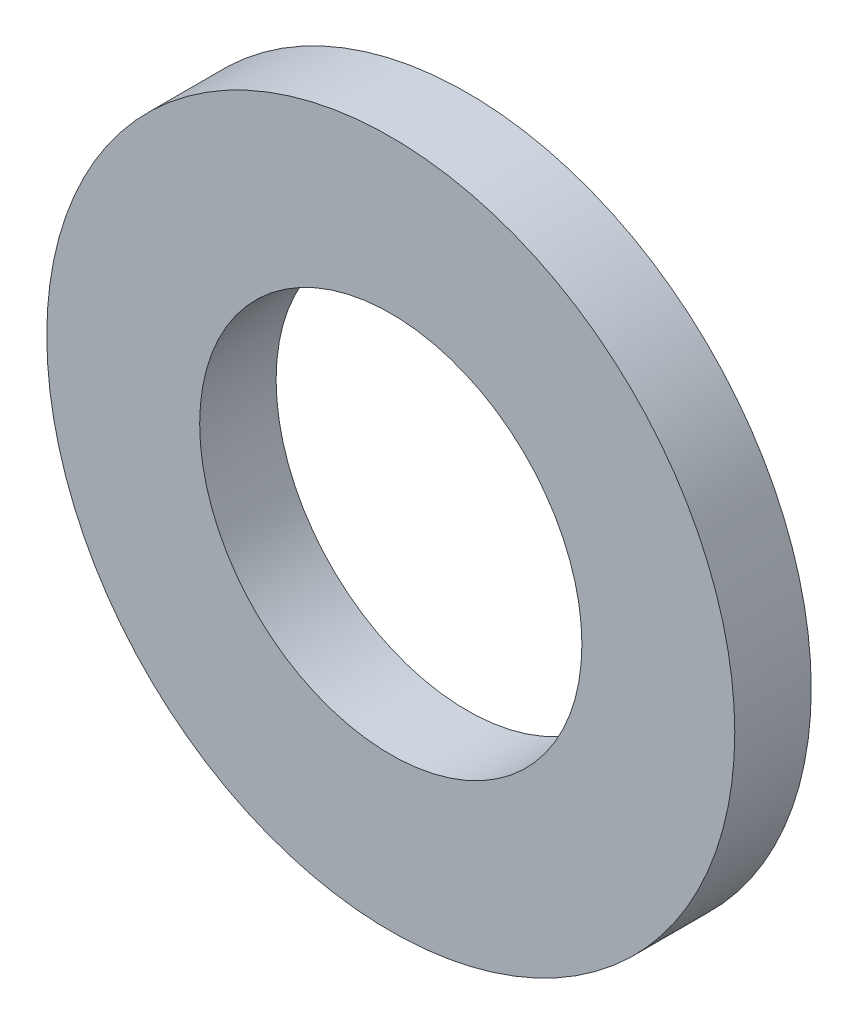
from build123d import *

# Parameters (mm, degrees)
ESQUISSE1_R      = 9
ESQUISSE1_R_2    = 5
EXTRUSION1_DEPTH = 2


with BuildPart() as part:
    # Esquisse1 → Extrusion1 (new body)
    with BuildSketch(Plane.XY):
        Circle(ESQUISSE1_R)
        Circle(ESQUISSE1_R_2, mode=Mode.SUBTRACT)
    extrude(amount=EXTRUSION1_DEPTH)


solid = part.part
